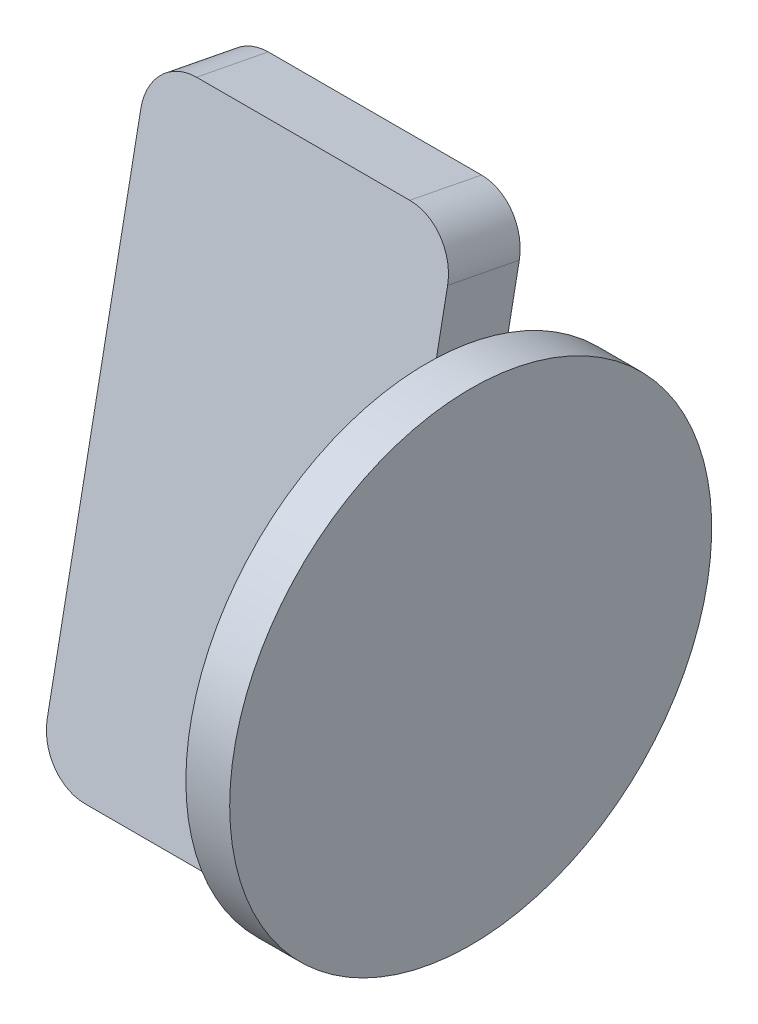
ISO-10303-21;
HEADER;
FILE_DESCRIPTION(('STEP AP214'),'2;1');
FILE_NAME('part.step','',(''),(''),'','','');
FILE_SCHEMA(('AUTOMOTIVE_DESIGN { 1 0 10303 214 1 1 1 1 }'));
ENDSEC;
DATA;
#1=APPLICATION_CONTEXT('core data for automotive mechanical design processes');
#2=APPLICATION_PROTOCOL_DEFINITION('international standard','automotive_design',2000,#1);
#3=PRODUCT_CONTEXT('',#1,'mechanical');
#4=PRODUCT('Part','Part','',(#3));
#5=PRODUCT_RELATED_PRODUCT_CATEGORY('part','',(#4));
#6=PRODUCT_DEFINITION_FORMATION('','',#4);
#7=PRODUCT_DEFINITION_CONTEXT('part definition',#1,'design');
#8=PRODUCT_DEFINITION('design','',#6,#7);
#9=PRODUCT_DEFINITION_SHAPE('','',#8);
#10=(LENGTH_UNIT() NAMED_UNIT(*) SI_UNIT(.MILLI.,.METRE.));
#11=(NAMED_UNIT(*) PLANE_ANGLE_UNIT() SI_UNIT($,.RADIAN.));
#12=(NAMED_UNIT(*) SI_UNIT($,.STERADIAN.) SOLID_ANGLE_UNIT());
#13=UNCERTAINTY_MEASURE_WITH_UNIT(LENGTH_MEASURE(1.E-05),#10,'distance_accuracy_value','');
#14=(GEOMETRIC_REPRESENTATION_CONTEXT(3) GLOBAL_UNCERTAINTY_ASSIGNED_CONTEXT((#13)) GLOBAL_UNIT_ASSIGNED_CONTEXT((#10,
#11,#12)) REPRESENTATION_CONTEXT('',''));
#15=CARTESIAN_POINT('',(0.,0.,0.));
#16=DIRECTION('',(0.,0.,1.));
#17=DIRECTION('',(1.,0.,0.));
#18=AXIS2_PLACEMENT_3D('',#15,#16,#17);
#19=CARTESIAN_POINT('',(-923.973612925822,-375.820398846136,-397.783783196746));
#20=DIRECTION('',(0.,-0.981627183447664,0.190808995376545));
#21=DIRECTION('',(0.,-0.190808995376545,-0.981627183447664));
#22=AXIS2_PLACEMENT_3D('',#19,#20,#21);
#23=PLANE('',#22);
#24=DIRECTION('',(0.,-0.19080899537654,-0.981627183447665));
#25=VECTOR('',#24,1.);
#26=CARTESIAN_POINT('',(-928.609112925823,-375.517489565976,-396.225450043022));
#27=LINE('',#26,#25);
#28=CARTESIAN_POINT('',(-928.609112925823,-375.517489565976,-396.225450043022));
#29=VERTEX_POINT('',#28);
#30=CARTESIAN_POINT('',(-928.609112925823,-376.123308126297,-399.342116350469));
#31=VERTEX_POINT('',#30);
#32=EDGE_CURVE('E144',#29,#31,#27,.T.);
#33=ORIENTED_EDGE('',*,*,#32,.F.);
#34=DIRECTION('',(1.,0.,0.));
#35=VECTOR('',#34,1.);
#36=CARTESIAN_POINT('',(-923.973612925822,-375.517489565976,-396.225450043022));
#37=LINE('',#36,#35);
#38=CARTESIAN_POINT('',(-919.338112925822,-375.517489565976,-396.225450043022));
#39=VERTEX_POINT('',#38);
#40=EDGE_CURVE('E168',#29,#39,#37,.T.);
#41=ORIENTED_EDGE('',*,*,#40,.T.);
#42=DIRECTION('',(0.,0.190808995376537,0.981627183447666));
#43=VECTOR('',#42,1.);
#44=CARTESIAN_POINT('',(-919.338112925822,-376.123308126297,-399.342116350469));
#45=LINE('',#44,#43);
#46=CARTESIAN_POINT('',(-919.338112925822,-376.123308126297,-399.342116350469));
#47=VERTEX_POINT('',#46);
#48=EDGE_CURVE('E87',#47,#39,#45,.T.);
#49=ORIENTED_EDGE('',*,*,#48,.F.);
#50=DIRECTION('',(1.,0.,0.));
#51=VECTOR('',#50,1.);
#52=CARTESIAN_POINT('',(-923.973612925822,-376.123308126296,-399.342116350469));
#53=LINE('',#52,#51);
#54=EDGE_CURVE('E165',#47,#31,#53,.F.);
#55=ORIENTED_EDGE('',*,*,#54,.T.);
#56=EDGE_LOOP('',(#33,#41,#49,#55));
#57=FACE_BOUND('',#56,.T.);
#58=ADVANCED_FACE('F17',(#57),#23,.F.);
#59=CARTESIAN_POINT('',(-928.609112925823,-377.512156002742,-395.837726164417));
#60=DIRECTION('',(0.,-0.19080899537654,-0.981627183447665));
#61=DIRECTION('',(0.,0.981627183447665,-0.19080899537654));
#62=AXIS2_PLACEMENT_3D('',#59,#60,#61);
#63=CYLINDRICAL_SURFACE('',#62,2.032);
#64=DIRECTION('',(0.,-0.190808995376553,-0.981627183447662));
#65=VECTOR('',#64,1.);
#66=CARTESIAN_POINT('',(-930.641112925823,-377.512156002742,-395.837726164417));
#67=LINE('',#66,#65);
#68=CARTESIAN_POINT('',(-930.641112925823,-377.512156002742,-395.837726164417));
#69=VERTEX_POINT('',#68);
#70=CARTESIAN_POINT('',(-930.641112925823,-378.117974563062,-398.954392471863));
#71=VERTEX_POINT('',#70);
#72=EDGE_CURVE('E141',#69,#71,#67,.T.);
#73=ORIENTED_EDGE('',*,*,#72,.F.);
#74=CARTESIAN_POINT('',(-928.609112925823,-377.512156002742,-395.837726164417));
#75=DIRECTION('',(0.,-0.19080899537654,-0.981627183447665));
#76=DIRECTION('',(0.,0.981627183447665,-0.19080899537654));
#77=AXIS2_PLACEMENT_3D('',#74,#75,#76);
#78=CIRCLE('',#77,2.032);
#79=EDGE_CURVE('E169',#69,#29,#78,.T.);
#80=ORIENTED_EDGE('',*,*,#79,.T.);
#81=ORIENTED_EDGE('',*,*,#32,.T.);
#82=CARTESIAN_POINT('',(-928.609112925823,-378.117974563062,-398.954392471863));
#83=DIRECTION('',(0.,-0.19080899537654,-0.981627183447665));
#84=DIRECTION('',(0.,0.981627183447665,-0.19080899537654));
#85=AXIS2_PLACEMENT_3D('',#82,#83,#84);
#86=CIRCLE('',#85,2.032);
#87=EDGE_CURVE('E163',#31,#71,#86,.F.);
#88=ORIENTED_EDGE('',*,*,#87,.T.);
#89=EDGE_LOOP('',(#73,#80,#81,#88));
#90=FACE_BOUND('',#89,.T.);
#91=ADVANCED_FACE('F182',(#90),#63,.T.);
#92=CARTESIAN_POINT('',(-930.641112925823,-388.287064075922,-395.360508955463));
#93=DIRECTION('',(-1.,0.,0.));
#94=DIRECTION('',(0.,0.,1.));
#95=AXIS2_PLACEMENT_3D('',#92,#93,#94);
#96=PLANE('',#95);
#97=ORIENTED_EDGE('',*,*,#72,.T.);
#98=DIRECTION('',(0.,-0.981627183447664,0.190808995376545));
#99=VECTOR('',#98,1.);
#100=CARTESIAN_POINT('',(-930.641112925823,-388.589973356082,-396.918842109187));
#101=LINE('',#100,#99);
#102=CARTESIAN_POINT('',(-930.641112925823,-399.061972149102,-394.883291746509));
#103=VERTEX_POINT('',#102);
#104=EDGE_CURVE('E162',#71,#103,#101,.T.);
#105=ORIENTED_EDGE('',*,*,#104,.T.);
#106=DIRECTION('',(0.,0.190808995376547,0.981627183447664));
#107=VECTOR('',#106,1.);
#108=CARTESIAN_POINT('',(-930.641112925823,-399.061972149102,-394.883291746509));
#109=LINE('',#108,#107);
#110=CARTESIAN_POINT('',(-930.641112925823,-398.456153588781,-391.766625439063));
#111=VERTEX_POINT('',#110);
#112=EDGE_CURVE('E135',#111,#103,#109,.F.);
#113=ORIENTED_EDGE('',*,*,#112,.F.);
#114=DIRECTION('',(0.,0.981627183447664,-0.190808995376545));
#115=VECTOR('',#114,1.);
#116=CARTESIAN_POINT('',(-930.641112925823,-387.984154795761,-393.80217580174));
#117=LINE('',#116,#115);
#118=EDGE_CURVE('E122',#111,#69,#117,.T.);
#119=ORIENTED_EDGE('',*,*,#118,.T.);
#120=EDGE_LOOP('',(#97,#105,#113,#119));
#121=FACE_BOUND('',#120,.T.);
#122=ADVANCED_FACE('F175',(#121),#96,.T.);
#123=CARTESIAN_POINT('',(-928.609112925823,-399.061972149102,-394.883291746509));
#124=DIRECTION('',(0.,0.190808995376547,0.981627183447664));
#125=DIRECTION('',(0.,-0.981627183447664,0.190808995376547));
#126=AXIS2_PLACEMENT_3D('',#123,#124,#125);
#127=CYLINDRICAL_SURFACE('',#126,2.032);
#128=DIRECTION('',(0.,0.190808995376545,0.981627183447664));
#129=VECTOR('',#128,1.);
#130=CARTESIAN_POINT('',(-928.609112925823,-400.753729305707,-392.937234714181));
#131=LINE('',#130,#129);
#132=CARTESIAN_POINT('',(-928.609112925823,-401.056638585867,-394.495567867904));
#133=VERTEX_POINT('',#132);
#134=CARTESIAN_POINT('',(-928.609112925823,-400.450820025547,-391.378901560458));
#135=VERTEX_POINT('',#134);
#136=EDGE_CURVE('E114',#133,#135,#131,.T.);
#137=ORIENTED_EDGE('',*,*,#136,.T.);
#138=CARTESIAN_POINT('',(-928.609112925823,-398.456153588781,-391.766625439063));
#139=DIRECTION('',(0.,0.190808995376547,0.981627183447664));
#140=DIRECTION('',(0.,-0.981627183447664,0.190808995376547));
#141=AXIS2_PLACEMENT_3D('',#138,#139,#140);
#142=CIRCLE('',#141,2.032);
#143=EDGE_CURVE('E120',#135,#111,#142,.F.);
#144=ORIENTED_EDGE('',*,*,#143,.T.);
#145=ORIENTED_EDGE('',*,*,#112,.T.);
#146=CARTESIAN_POINT('',(-928.609112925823,-399.061972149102,-394.883291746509));
#147=DIRECTION('',(0.,0.190808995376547,0.981627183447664));
#148=DIRECTION('',(0.,-0.981627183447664,0.190808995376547));
#149=AXIS2_PLACEMENT_3D('',#146,#147,#148);
#150=CIRCLE('',#149,2.032);
#151=EDGE_CURVE('E160',#103,#133,#150,.T.);
#152=ORIENTED_EDGE('',*,*,#151,.T.);
#153=EDGE_LOOP('',(#137,#144,#145,#152));
#154=FACE_BOUND('',#153,.T.);
#155=ADVANCED_FACE('F244',(#154),#127,.T.);
#156=CARTESIAN_POINT('',(-923.973612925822,-400.753729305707,-392.937234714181));
#157=DIRECTION('',(0.,0.981627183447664,-0.190808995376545));
#158=DIRECTION('',(0.,0.190808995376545,0.981627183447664));
#159=AXIS2_PLACEMENT_3D('',#156,#157,#158);
#160=PLANE('',#159);
#161=DIRECTION('',(0.,0.190808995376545,0.981627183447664));
#162=VECTOR('',#161,1.);
#163=CARTESIAN_POINT('',(-917.306112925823,-400.753729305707,-392.937234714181));
#164=LINE('',#163,#162);
#165=CARTESIAN_POINT('',(-917.306112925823,-400.753729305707,-392.937234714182));
#166=VERTEX_POINT('',#165);
#167=CARTESIAN_POINT('',(-917.306112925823,-401.056638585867,-394.495567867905));
#168=VERTEX_POINT('',#167);
#169=EDGE_CURVE('E113',#166,#168,#164,.F.);
#170=ORIENTED_EDGE('',*,*,#169,.F.);
#171=DIRECTION('',(0.,0.190808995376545,0.981627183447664));
#172=VECTOR('',#171,1.);
#173=CARTESIAN_POINT('',(-917.306112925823,-400.753729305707,-392.937234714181));
#174=LINE('',#173,#172);
#175=CARTESIAN_POINT('',(-917.306112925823,-400.450820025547,-391.378901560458));
#176=VERTEX_POINT('',#175);
#177=EDGE_CURVE('E95',#176,#166,#174,.F.);
#178=ORIENTED_EDGE('',*,*,#177,.F.);
#179=DIRECTION('',(1.,0.,0.));
#180=VECTOR('',#179,1.);
#181=CARTESIAN_POINT('',(-923.973612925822,-400.450820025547,-391.378901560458));
#182=LINE('',#181,#180);
#183=EDGE_CURVE('E103',#176,#135,#182,.F.);
#184=ORIENTED_EDGE('',*,*,#183,.T.);
#185=ORIENTED_EDGE('',*,*,#136,.F.);
#186=DIRECTION('',(1.,0.,0.));
#187=VECTOR('',#186,1.);
#188=CARTESIAN_POINT('',(-923.973612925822,-401.056638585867,-394.495567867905));
#189=LINE('',#188,#187);
#190=EDGE_CURVE('E133',#133,#168,#189,.T.);
#191=ORIENTED_EDGE('',*,*,#190,.T.);
#192=EDGE_LOOP('',(#170,#178,#184,#185,#191));
#193=FACE_BOUND('',#192,.T.);
#194=ADVANCED_FACE('F108',(#193),#160,.F.);
#195=CARTESIAN_POINT('',(-919.338112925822,-378.117974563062,-398.954392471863));
#196=DIRECTION('',(0.,0.190808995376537,0.981627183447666));
#197=DIRECTION('',(0.,-0.981627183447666,0.190808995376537));
#198=AXIS2_PLACEMENT_3D('',#195,#196,#197);
#199=CYLINDRICAL_SURFACE('',#198,2.032);
#200=ORIENTED_EDGE('',*,*,#48,.T.);
#201=CARTESIAN_POINT('',(-919.338112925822,-377.512156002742,-395.837726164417));
#202=DIRECTION('',(0.,0.190808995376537,0.981627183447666));
#203=DIRECTION('',(0.,-0.981627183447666,0.190808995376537));
#204=AXIS2_PLACEMENT_3D('',#201,#202,#203);
#205=CIRCLE('',#204,2.032);
#206=CARTESIAN_POINT('',(-917.306112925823,-377.512156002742,-395.837726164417));
#207=VERTEX_POINT('',#206);
#208=EDGE_CURVE('E20',#39,#207,#205,.F.);
#209=ORIENTED_EDGE('',*,*,#208,.T.);
#210=DIRECTION('',(0.,-0.19080899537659,-0.981627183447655));
#211=VECTOR('',#210,1.);
#212=CARTESIAN_POINT('',(-917.306112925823,-377.512156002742,-395.837726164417));
#213=LINE('',#212,#211);
#214=CARTESIAN_POINT('',(-917.306112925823,-378.117974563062,-398.954392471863));
#215=VERTEX_POINT('',#214);
#216=EDGE_CURVE('E130',#207,#215,#213,.T.);
#217=ORIENTED_EDGE('',*,*,#216,.T.);
#218=CARTESIAN_POINT('',(-919.338112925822,-378.117974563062,-398.954392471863));
#219=DIRECTION('',(0.,0.190808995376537,0.981627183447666));
#220=DIRECTION('',(0.,-0.981627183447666,0.190808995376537));
#221=AXIS2_PLACEMENT_3D('',#218,#219,#220);
#222=CIRCLE('',#221,2.032);
#223=EDGE_CURVE('E166',#215,#47,#222,.T.);
#224=ORIENTED_EDGE('',*,*,#223,.T.);
#225=EDGE_LOOP('',(#200,#209,#217,#224));
#226=FACE_BOUND('',#225,.T.);
#227=ADVANCED_FACE('F214',(#226),#199,.T.);
#228=CARTESIAN_POINT('',(-923.973612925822,-387.984154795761,-393.80217580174));
#229=DIRECTION('',(0.,-0.190808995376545,-0.981627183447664));
#230=DIRECTION('',(0.,0.981627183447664,-0.190808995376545));
#231=AXIS2_PLACEMENT_3D('',#228,#229,#230);
#232=PLANE('',#231);
#233=ORIENTED_EDGE('',*,*,#79,.F.);
#234=ORIENTED_EDGE('',*,*,#118,.F.);
#235=ORIENTED_EDGE('',*,*,#143,.F.);
#236=ORIENTED_EDGE('',*,*,#183,.F.);
#237=DIRECTION('',(0.,0.981627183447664,-0.190808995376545));
#238=VECTOR('',#237,1.);
#239=CARTESIAN_POINT('',(-917.306112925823,-387.984154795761,-393.80217580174));
#240=LINE('',#239,#238);
#241=CARTESIAN_POINT('',(-917.306112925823,-400.332079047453,-391.401982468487));
#242=VERTEX_POINT('',#241);
#243=EDGE_CURVE('E92',#242,#176,#240,.F.);
#244=ORIENTED_EDGE('',*,*,#243,.F.);
#245=DIRECTION('',(0.,-0.981627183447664,0.190808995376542));
#246=VECTOR('',#245,1.);
#247=CARTESIAN_POINT('',(-917.306112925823,-379.999563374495,-395.354223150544));
#248=LINE('',#247,#246);
#249=CARTESIAN_POINT('',(-917.306112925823,-379.999563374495,-395.354223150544));
#250=VERTEX_POINT('',#249);
#251=EDGE_CURVE('E196',#250,#242,#248,.T.);
#252=ORIENTED_EDGE('',*,*,#251,.F.);
#253=DIRECTION('',(0.,0.981627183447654,-0.190808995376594));
#254=VECTOR('',#253,1.);
#255=CARTESIAN_POINT('',(-917.306112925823,-379.999563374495,-395.354223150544));
#256=LINE('',#255,#254);
#257=EDGE_CURVE('E194',#250,#207,#256,.T.);
#258=ORIENTED_EDGE('',*,*,#257,.T.);
#259=ORIENTED_EDGE('',*,*,#208,.F.);
#260=ORIENTED_EDGE('',*,*,#40,.F.);
#261=EDGE_LOOP('',(#233,#234,#235,#236,#244,#252,#258,#259,#260));
#262=FACE_BOUND('',#261,.T.);
#263=ADVANCED_FACE('F117',(#262),#232,.F.);
#264=CARTESIAN_POINT('',(-923.973612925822,-388.589973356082,-396.918842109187));
#265=DIRECTION('',(0.,0.190808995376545,0.981627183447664));
#266=DIRECTION('',(0.,-0.981627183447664,0.190808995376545));
#267=AXIS2_PLACEMENT_3D('',#264,#265,#266);
#268=PLANE('',#267);
#269=DIRECTION('',(0.,0.981627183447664,-0.190808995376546));
#270=VECTOR('',#269,1.);
#271=CARTESIAN_POINT('',(-917.306112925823,-400.937897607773,-394.518648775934));
#272=LINE('',#271,#270);
#273=CARTESIAN_POINT('',(-917.306112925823,-400.937897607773,-394.518648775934));
#274=VERTEX_POINT('',#273);
#275=CARTESIAN_POINT('',(-917.306112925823,-380.605381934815,-398.470889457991));
#276=VERTEX_POINT('',#275);
#277=EDGE_CURVE('E35',#274,#276,#272,.T.);
#278=ORIENTED_EDGE('',*,*,#277,.F.);
#279=DIRECTION('',(0.,-0.981627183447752,0.190808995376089));
#280=VECTOR('',#279,1.);
#281=CARTESIAN_POINT('',(-917.306112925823,-400.937897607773,-394.518648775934));
#282=LINE('',#281,#280);
#283=EDGE_CURVE('E198',#274,#168,#282,.T.);
#284=ORIENTED_EDGE('',*,*,#283,.T.);
#285=ORIENTED_EDGE('',*,*,#190,.F.);
#286=ORIENTED_EDGE('',*,*,#151,.F.);
#287=ORIENTED_EDGE('',*,*,#104,.F.);
#288=ORIENTED_EDGE('',*,*,#87,.F.);
#289=ORIENTED_EDGE('',*,*,#54,.F.);
#290=ORIENTED_EDGE('',*,*,#223,.F.);
#291=DIRECTION('',(0.,-0.981627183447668,0.190808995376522));
#292=VECTOR('',#291,1.);
#293=CARTESIAN_POINT('',(-917.306112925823,-378.117974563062,-398.954392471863));
#294=LINE('',#293,#292);
#295=EDGE_CURVE('E132',#215,#276,#294,.T.);
#296=ORIENTED_EDGE('',*,*,#295,.T.);
#297=EDGE_LOOP('',(#278,#284,#285,#286,#287,#288,#289,#290,#296));
#298=FACE_BOUND('',#297,.T.);
#299=ADVANCED_FACE('F183',(#298),#268,.F.);
#300=CARTESIAN_POINT('',(-917.306112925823,-388.287064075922,-395.360508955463));
#301=DIRECTION('',(-1.,0.,0.));
#302=DIRECTION('',(0.,0.,1.));
#303=AXIS2_PLACEMENT_3D('',#300,#301,#302);
#304=PLANE('',#303);
#305=CARTESIAN_POINT('',(-917.306112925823,-390.468730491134,-394.936435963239));
#306=DIRECTION('',(-1.,0.,0.));
#307=DIRECTION('',(0.,0.,1.));
#308=AXIS2_PLACEMENT_3D('',#305,#306,#307);
#309=CIRCLE('',#308,10.4775);
#310=EDGE_CURVE('E157',#276,#250,#309,.F.);
#311=ORIENTED_EDGE('',*,*,#310,.F.);
#312=ORIENTED_EDGE('',*,*,#295,.F.);
#313=ORIENTED_EDGE('',*,*,#216,.F.);
#314=ORIENTED_EDGE('',*,*,#257,.F.);
#315=EDGE_LOOP('',(#311,#312,#313,#314));
#316=FACE_BOUND('',#315,.T.);
#317=ADVANCED_FACE('F209',(#316),#304,.F.);
#318=CARTESIAN_POINT('',(-917.306112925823,-390.468730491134,-394.936435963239));
#319=DIRECTION('',(-1.,0.,0.));
#320=DIRECTION('',(0.,0.,1.));
#321=AXIS2_PLACEMENT_3D('',#318,#319,#320);
#322=PLANE('',#321);
#323=CARTESIAN_POINT('',(-917.306112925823,-390.468730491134,-394.936435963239));
#324=DIRECTION('',(-1.,0.,0.));
#325=DIRECTION('',(0.,0.,1.));
#326=AXIS2_PLACEMENT_3D('',#323,#324,#325);
#327=CIRCLE('',#326,10.4775);
#328=EDGE_CURVE('E155',#250,#242,#327,.F.);
#329=ORIENTED_EDGE('',*,*,#328,.F.);
#330=ORIENTED_EDGE('',*,*,#251,.T.);
#331=EDGE_LOOP('',(#329,#330));
#332=FACE_BOUND('',#331,.T.);
#333=ADVANCED_FACE('F216',(#332),#322,.T.);
#334=CARTESIAN_POINT('',(-917.306112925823,-388.287064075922,-395.360508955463));
#335=DIRECTION('',(-1.,0.,0.));
#336=DIRECTION('',(0.,0.,1.));
#337=AXIS2_PLACEMENT_3D('',#334,#335,#336);
#338=PLANE('',#337);
#339=ORIENTED_EDGE('',*,*,#177,.T.);
#340=CARTESIAN_POINT('',(-917.306112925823,-390.468730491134,-394.936435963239));
#341=DIRECTION('',(-1.,0.,0.));
#342=DIRECTION('',(0.,0.,1.));
#343=AXIS2_PLACEMENT_3D('',#340,#341,#342);
#344=CIRCLE('',#343,10.4775);
#345=EDGE_CURVE('E97',#242,#166,#344,.F.);
#346=ORIENTED_EDGE('',*,*,#345,.F.);
#347=ORIENTED_EDGE('',*,*,#243,.T.);
#348=EDGE_LOOP('',(#339,#346,#347));
#349=FACE_BOUND('',#348,.T.);
#350=ADVANCED_FACE('F94',(#349),#338,.F.);
#351=CARTESIAN_POINT('',(-917.306112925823,-388.287064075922,-395.360508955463));
#352=DIRECTION('',(-1.,0.,0.));
#353=DIRECTION('',(0.,0.,1.));
#354=AXIS2_PLACEMENT_3D('',#351,#352,#353);
#355=PLANE('',#354);
#356=ORIENTED_EDGE('',*,*,#283,.F.);
#357=CARTESIAN_POINT('',(-917.306112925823,-390.468730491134,-394.936435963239));
#358=DIRECTION('',(-1.,0.,0.));
#359=DIRECTION('',(0.,0.,1.));
#360=AXIS2_PLACEMENT_3D('',#357,#358,#359);
#361=CIRCLE('',#360,10.4775);
#362=EDGE_CURVE('E151',#166,#274,#361,.F.);
#363=ORIENTED_EDGE('',*,*,#362,.F.);
#364=ORIENTED_EDGE('',*,*,#169,.T.);
#365=EDGE_LOOP('',(#356,#363,#364));
#366=FACE_BOUND('',#365,.T.);
#367=ADVANCED_FACE('F224',(#366),#355,.F.);
#368=CARTESIAN_POINT('',(-917.306112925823,-390.468730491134,-394.936435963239));
#369=DIRECTION('',(-1.,0.,0.));
#370=DIRECTION('',(0.,0.,1.));
#371=AXIS2_PLACEMENT_3D('',#368,#369,#370);
#372=PLANE('',#371);
#373=ORIENTED_EDGE('',*,*,#277,.T.);
#374=CARTESIAN_POINT('',(-917.306112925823,-390.468730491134,-394.936435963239));
#375=DIRECTION('',(-1.,0.,0.));
#376=DIRECTION('',(0.,0.,1.));
#377=AXIS2_PLACEMENT_3D('',#374,#375,#376);
#378=CIRCLE('',#377,10.4775);
#379=EDGE_CURVE('E26',#274,#276,#378,.F.);
#380=ORIENTED_EDGE('',*,*,#379,.F.);
#381=EDGE_LOOP('',(#373,#380));
#382=FACE_BOUND('',#381,.T.);
#383=ADVANCED_FACE('F205',(#382),#372,.T.);
#384=CARTESIAN_POINT('',(-915.401112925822,-390.468730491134,-394.936435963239));
#385=DIRECTION('',(-1.,0.,0.));
#386=DIRECTION('',(0.,0.,1.));
#387=AXIS2_PLACEMENT_3D('',#384,#385,#386);
#388=CYLINDRICAL_SURFACE('',#387,10.4775);
#389=CARTESIAN_POINT('',(-915.401112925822,-390.468730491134,-394.936435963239));
#390=DIRECTION('',(-1.,0.,0.));
#391=DIRECTION('',(0.,0.,1.));
#392=AXIS2_PLACEMENT_3D('',#389,#390,#391);
#393=CIRCLE('',#392,10.4775);
#394=CARTESIAN_POINT('',(-915.401112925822,-390.468730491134,-384.458935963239));
#395=VERTEX_POINT('',#394);
#396=EDGE_CURVE('E11',#395,#395,#393,.F.);
#397=ORIENTED_EDGE('',*,*,#396,.F.);
#398=EDGE_LOOP('',(#397));
#399=FACE_BOUND('',#398,.T.);
#400=ORIENTED_EDGE('',*,*,#362,.T.);
#401=ORIENTED_EDGE('',*,*,#379,.T.);
#402=ORIENTED_EDGE('',*,*,#310,.T.);
#403=ORIENTED_EDGE('',*,*,#328,.T.);
#404=ORIENTED_EDGE('',*,*,#345,.T.);
#405=EDGE_LOOP('',(#400,#401,#402,#403,#404));
#406=FACE_BOUND('',#405,.T.);
#407=ADVANCED_FACE('F212',(#399,#406),#388,.T.);
#408=CARTESIAN_POINT('',(-915.401112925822,-390.468730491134,-394.936435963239));
#409=DIRECTION('',(1.,0.,0.));
#410=DIRECTION('',(0.,0.,-1.));
#411=AXIS2_PLACEMENT_3D('',#408,#409,#410);
#412=PLANE('',#411);
#413=ORIENTED_EDGE('',*,*,#396,.T.);
#414=EDGE_LOOP('',(#413));
#415=FACE_BOUND('',#414,.T.);
#416=ADVANCED_FACE('F227',(#415),#412,.T.);
#417=CLOSED_SHELL('',(#58,#91,#122,#155,#194,#227,#263,#299,#317,#333,#350,#367,#383,#407,#416));
#418=MANIFOLD_SOLID_BREP('B1',#417);
#419=ADVANCED_BREP_SHAPE_REPRESENTATION('',(#18,#418),#14);
#420=SHAPE_DEFINITION_REPRESENTATION(#9,#419);
ENDSEC;
END-ISO-10303-21;
